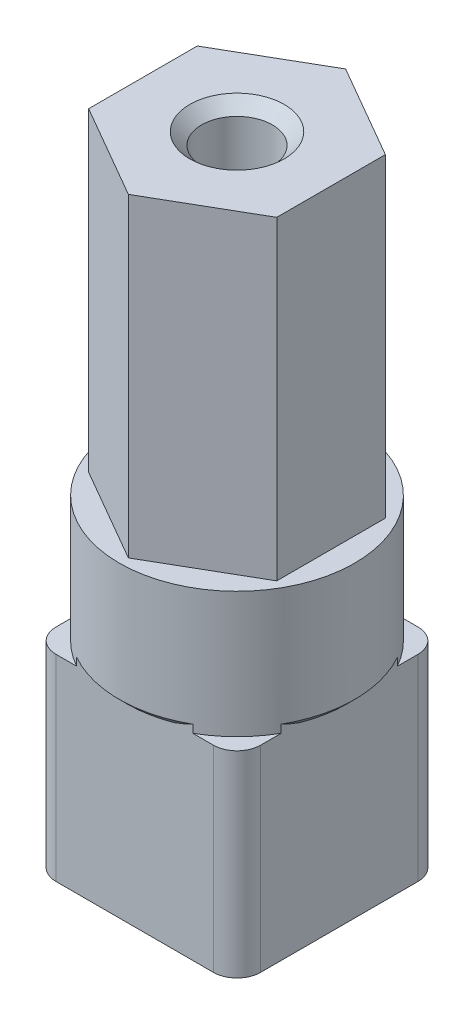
ISO-10303-21;
HEADER;
FILE_DESCRIPTION(('STEP AP214'),'2;1');
FILE_NAME('part.step','',(''),(''),'','','');
FILE_SCHEMA(('AUTOMOTIVE_DESIGN { 1 0 10303 214 1 1 1 1 }'));
ENDSEC;
DATA;
#1=APPLICATION_CONTEXT('core data for automotive mechanical design processes');
#2=APPLICATION_PROTOCOL_DEFINITION('international standard','automotive_design',2000,#1);
#3=PRODUCT_CONTEXT('',#1,'mechanical');
#4=PRODUCT('Part','Part','',(#3));
#5=PRODUCT_RELATED_PRODUCT_CATEGORY('part','',(#4));
#6=PRODUCT_DEFINITION_FORMATION('','',#4);
#7=PRODUCT_DEFINITION_CONTEXT('part definition',#1,'design');
#8=PRODUCT_DEFINITION('design','',#6,#7);
#9=PRODUCT_DEFINITION_SHAPE('','',#8);
#10=(LENGTH_UNIT() NAMED_UNIT(*) SI_UNIT(.MILLI.,.METRE.));
#11=(NAMED_UNIT(*) PLANE_ANGLE_UNIT() SI_UNIT($,.RADIAN.));
#12=(NAMED_UNIT(*) SI_UNIT($,.STERADIAN.) SOLID_ANGLE_UNIT());
#13=UNCERTAINTY_MEASURE_WITH_UNIT(LENGTH_MEASURE(1.E-05),#10,'distance_accuracy_value','');
#14=(GEOMETRIC_REPRESENTATION_CONTEXT(3) GLOBAL_UNCERTAINTY_ASSIGNED_CONTEXT((#13)) GLOBAL_UNIT_ASSIGNED_CONTEXT((#10,
#11,#12)) REPRESENTATION_CONTEXT('',''));
#15=CARTESIAN_POINT('',(0.,0.,0.));
#16=DIRECTION('',(0.,0.,1.));
#17=DIRECTION('',(1.,0.,0.));
#18=AXIS2_PLACEMENT_3D('',#15,#16,#17);
#19=CARTESIAN_POINT('',(0.,41.,0.));
#20=DIRECTION('',(0.,1.,0.));
#21=DIRECTION('',(0.,0.,1.));
#22=AXIS2_PLACEMENT_3D('',#19,#20,#21);
#23=PLANE('',#22);
#24=CARTESIAN_POINT('',(0.,41.,0.));
#25=DIRECTION('',(0.,1.,0.));
#26=DIRECTION('',(0.,0.,1.));
#27=AXIS2_PLACEMENT_3D('',#24,#25,#26);
#28=CIRCLE('',#27,14.95);
#29=CARTESIAN_POINT('',(0.,41.,14.95));
#30=VERTEX_POINT('',#29);
#31=EDGE_CURVE('E244',#30,#30,#28,.T.);
#32=ORIENTED_EDGE('',*,*,#31,.T.);
#33=EDGE_LOOP('',(#32));
#34=FACE_BOUND('',#33,.T.);
#35=DIRECTION('',(-0.866025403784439,0.,0.5));
#36=VECTOR('',#35,1.);
#37=CARTESIAN_POINT('',(0.,41.,-13.7986714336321));
#38=LINE('',#37,#36);
#39=CARTESIAN_POINT('',(0.,41.,-13.7986714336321));
#40=VERTEX_POINT('',#39);
#41=CARTESIAN_POINT('',(-11.95,41.,-6.89933571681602));
#42=VERTEX_POINT('',#41);
#43=EDGE_CURVE('E943',#40,#42,#38,.T.);
#44=ORIENTED_EDGE('',*,*,#43,.F.);
#45=DIRECTION('',(-0.866025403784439,0.,-0.5));
#46=VECTOR('',#45,1.);
#47=CARTESIAN_POINT('',(11.95,41.,-6.89933571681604));
#48=LINE('',#47,#46);
#49=CARTESIAN_POINT('',(11.95,41.,-6.89933571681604));
#50=VERTEX_POINT('',#49);
#51=EDGE_CURVE('E236',#50,#40,#48,.T.);
#52=ORIENTED_EDGE('',*,*,#51,.F.);
#53=DIRECTION('',(0.,0.,-1.));
#54=VECTOR('',#53,1.);
#55=CARTESIAN_POINT('',(11.95,41.,6.89933571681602));
#56=LINE('',#55,#54);
#57=CARTESIAN_POINT('',(11.95,41.,6.89933571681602));
#58=VERTEX_POINT('',#57);
#59=EDGE_CURVE('E232',#58,#50,#56,.T.);
#60=ORIENTED_EDGE('',*,*,#59,.F.);
#61=DIRECTION('',(0.866025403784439,0.,-0.5));
#62=VECTOR('',#61,1.);
#63=CARTESIAN_POINT('',(0.,41.,13.798671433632));
#64=LINE('',#63,#62);
#65=CARTESIAN_POINT('',(0.,41.,13.798671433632));
#66=VERTEX_POINT('',#65);
#67=EDGE_CURVE('E953',#66,#58,#64,.T.);
#68=ORIENTED_EDGE('',*,*,#67,.F.);
#69=DIRECTION('',(0.866025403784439,0.,0.5));
#70=VECTOR('',#69,1.);
#71=CARTESIAN_POINT('',(-11.95,41.,6.89933571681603));
#72=LINE('',#71,#70);
#73=CARTESIAN_POINT('',(-11.95,41.,6.89933571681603));
#74=VERTEX_POINT('',#73);
#75=EDGE_CURVE('E942',#74,#66,#72,.T.);
#76=ORIENTED_EDGE('',*,*,#75,.F.);
#77=DIRECTION('',(0.,0.,1.));
#78=VECTOR('',#77,1.);
#79=CARTESIAN_POINT('',(-11.95,41.,-6.89933571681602));
#80=LINE('',#79,#78);
#81=EDGE_CURVE('E937',#42,#74,#80,.T.);
#82=ORIENTED_EDGE('',*,*,#81,.F.);
#83=EDGE_LOOP('',(#44,#52,#60,#68,#76,#82));
#84=FACE_BOUND('',#83,.T.);
#85=ADVANCED_FACE('F36',(#34,#84),#23,.T.);
#86=CARTESIAN_POINT('',(9.99999999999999,25.,9.99999999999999));
#87=DIRECTION('',(0.,1.,0.));
#88=DIRECTION('',(0.,0.,1.));
#89=AXIS2_PLACEMENT_3D('',#86,#87,#88);
#90=PLANE('',#89);
#91=CARTESIAN_POINT('',(0.,25.,0.));
#92=DIRECTION('',(0.,1.,0.));
#93=DIRECTION('',(0.,0.,1.));
#94=AXIS2_PLACEMENT_3D('',#91,#92,#93);
#95=CIRCLE('',#94,14.95);
#96=CARTESIAN_POINT('',(7.38258084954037,25.,13.));
#97=VERTEX_POINT('',#96);
#98=CARTESIAN_POINT('',(13.,25.,7.38258084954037));
#99=VERTEX_POINT('',#98);
#100=EDGE_CURVE('E239',#97,#99,#95,.T.);
#101=ORIENTED_EDGE('',*,*,#100,.F.);
#102=DIRECTION('',(1.,0.,0.));
#103=VECTOR('',#102,1.);
#104=CARTESIAN_POINT('',(9.99999999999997,25.,13.));
#105=LINE('',#104,#103);
#106=CARTESIAN_POINT('',(9.99999999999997,25.,13.));
#107=VERTEX_POINT('',#106);
#108=EDGE_CURVE('E289',#97,#107,#105,.T.);
#109=ORIENTED_EDGE('',*,*,#108,.T.);
#110=CARTESIAN_POINT('',(9.99999999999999,25.,9.99999999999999));
#111=DIRECTION('',(0.,1.,0.));
#112=DIRECTION('',(0.,0.,1.));
#113=AXIS2_PLACEMENT_3D('',#110,#111,#112);
#114=CIRCLE('',#113,3.);
#115=CARTESIAN_POINT('',(13.,25.,9.99999999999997));
#116=VERTEX_POINT('',#115);
#117=EDGE_CURVE('E257',#107,#116,#114,.T.);
#118=ORIENTED_EDGE('',*,*,#117,.T.);
#119=DIRECTION('',(0.,0.,-1.));
#120=VECTOR('',#119,1.);
#121=CARTESIAN_POINT('',(13.,25.,9.99999999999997));
#122=LINE('',#121,#120);
#123=EDGE_CURVE('E263',#116,#99,#122,.T.);
#124=ORIENTED_EDGE('',*,*,#123,.T.);
#125=EDGE_LOOP('',(#101,#109,#118,#124));
#126=FACE_BOUND('',#125,.T.);
#127=ADVANCED_FACE('F519',(#126),#90,.T.);
#128=CARTESIAN_POINT('',(13.,25.,-7.38258084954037));
#129=VERTEX_POINT('',#128);
#130=CARTESIAN_POINT('',(7.38258084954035,25.,-13.));
#131=VERTEX_POINT('',#130);
#132=EDGE_CURVE('E246',#129,#131,#95,.T.);
#133=ORIENTED_EDGE('',*,*,#132,.F.);
#134=CARTESIAN_POINT('',(13.,25.,-9.99999999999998));
#135=VERTEX_POINT('',#134);
#136=EDGE_CURVE('E261',#129,#135,#122,.T.);
#137=ORIENTED_EDGE('',*,*,#136,.T.);
#138=CARTESIAN_POINT('',(9.99999999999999,25.,-10.));
#139=DIRECTION('',(0.,1.,0.));
#140=DIRECTION('',(0.,0.,1.));
#141=AXIS2_PLACEMENT_3D('',#138,#139,#140);
#142=CIRCLE('',#141,3.);
#143=CARTESIAN_POINT('',(9.99999999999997,25.,-13.));
#144=VERTEX_POINT('',#143);
#145=EDGE_CURVE('E267',#135,#144,#142,.T.);
#146=ORIENTED_EDGE('',*,*,#145,.T.);
#147=DIRECTION('',(-1.,0.,0.));
#148=VECTOR('',#147,1.);
#149=CARTESIAN_POINT('',(9.99999999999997,25.,-13.));
#150=LINE('',#149,#148);
#151=EDGE_CURVE('E272',#144,#131,#150,.T.);
#152=ORIENTED_EDGE('',*,*,#151,.T.);
#153=EDGE_LOOP('',(#133,#137,#146,#152));
#154=FACE_BOUND('',#153,.T.);
#155=ADVANCED_FACE('F525',(#154),#90,.T.);
#156=CARTESIAN_POINT('',(-7.38258084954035,25.,-13.));
#157=VERTEX_POINT('',#156);
#158=CARTESIAN_POINT('',(-13.,25.,-7.38258084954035));
#159=VERTEX_POINT('',#158);
#160=EDGE_CURVE('E612',#157,#159,#95,.T.);
#161=ORIENTED_EDGE('',*,*,#160,.F.);
#162=CARTESIAN_POINT('',(-9.99999999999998,25.,-13.));
#163=VERTEX_POINT('',#162);
#164=EDGE_CURVE('E271',#157,#163,#150,.T.);
#165=ORIENTED_EDGE('',*,*,#164,.T.);
#166=CARTESIAN_POINT('',(-10.,25.,-10.));
#167=DIRECTION('',(0.,1.,0.));
#168=DIRECTION('',(0.,0.,1.));
#169=AXIS2_PLACEMENT_3D('',#166,#167,#168);
#170=CIRCLE('',#169,3.);
#171=CARTESIAN_POINT('',(-13.,25.,-9.99999999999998));
#172=VERTEX_POINT('',#171);
#173=EDGE_CURVE('E276',#163,#172,#170,.T.);
#174=ORIENTED_EDGE('',*,*,#173,.T.);
#175=DIRECTION('',(0.,0.,1.));
#176=VECTOR('',#175,1.);
#177=CARTESIAN_POINT('',(-13.,25.,9.99999999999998));
#178=LINE('',#177,#176);
#179=EDGE_CURVE('E281',#172,#159,#178,.T.);
#180=ORIENTED_EDGE('',*,*,#179,.T.);
#181=EDGE_LOOP('',(#161,#165,#174,#180));
#182=FACE_BOUND('',#181,.T.);
#183=ADVANCED_FACE('F545',(#182),#90,.T.);
#184=CARTESIAN_POINT('',(9.99999999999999,25.,9.99999999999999));
#185=DIRECTION('',(0.,-1.,0.));
#186=DIRECTION('',(0.,0.,-1.));
#187=AXIS2_PLACEMENT_3D('',#184,#185,#186);
#188=CYLINDRICAL_SURFACE('',#187,3.);
#189=CARTESIAN_POINT('',(9.99999999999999,0.,9.99999999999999));
#190=DIRECTION('',(0.,1.,0.));
#191=DIRECTION('',(0.,0.,1.));
#192=AXIS2_PLACEMENT_3D('',#189,#190,#191);
#193=CIRCLE('',#192,3.);
#194=CARTESIAN_POINT('',(9.99999999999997,0.,13.));
#195=VERTEX_POINT('',#194);
#196=CARTESIAN_POINT('',(13.,0.,9.99999999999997));
#197=VERTEX_POINT('',#196);
#198=EDGE_CURVE('E255',#195,#197,#193,.T.);
#199=ORIENTED_EDGE('',*,*,#198,.T.);
#200=DIRECTION('',(0.,-1.,0.));
#201=VECTOR('',#200,1.);
#202=CARTESIAN_POINT('',(13.,25.,9.99999999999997));
#203=LINE('',#202,#201);
#204=EDGE_CURVE('E345',#116,#197,#203,.T.);
#205=ORIENTED_EDGE('',*,*,#204,.F.);
#206=ORIENTED_EDGE('',*,*,#117,.F.);
#207=DIRECTION('',(0.,-1.,0.));
#208=VECTOR('',#207,1.);
#209=CARTESIAN_POINT('',(9.99999999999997,25.,13.));
#210=LINE('',#209,#208);
#211=EDGE_CURVE('E294',#107,#195,#210,.T.);
#212=ORIENTED_EDGE('',*,*,#211,.T.);
#213=EDGE_LOOP('',(#199,#205,#206,#212));
#214=FACE_BOUND('',#213,.T.);
#215=ADVANCED_FACE('F558',(#214),#188,.T.);
#216=CARTESIAN_POINT('',(13.,25.,9.99999999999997));
#217=DIRECTION('',(-1.,0.,0.));
#218=DIRECTION('',(0.,0.,1.));
#219=AXIS2_PLACEMENT_3D('',#216,#217,#218);
#220=PLANE('',#219);
#221=DIRECTION('',(0.,0.,-1.));
#222=VECTOR('',#221,1.);
#223=CARTESIAN_POINT('',(13.,0.,9.99999999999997));
#224=LINE('',#223,#222);
#225=CARTESIAN_POINT('',(13.,0.,-9.99999999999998));
#226=VERTEX_POINT('',#225);
#227=EDGE_CURVE('E299',#197,#226,#224,.T.);
#228=ORIENTED_EDGE('',*,*,#227,.T.);
#229=DIRECTION('',(0.,-1.,0.));
#230=VECTOR('',#229,1.);
#231=CARTESIAN_POINT('',(13.,25.,-9.99999999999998));
#232=LINE('',#231,#230);
#233=EDGE_CURVE('E341',#135,#226,#232,.T.);
#234=ORIENTED_EDGE('',*,*,#233,.F.);
#235=ORIENTED_EDGE('',*,*,#136,.F.);
#236=DIRECTION('',(0.,-1.,0.));
#237=VECTOR('',#236,1.);
#238=CARTESIAN_POINT('',(13.,26.,-7.38258084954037));
#239=LINE('',#238,#237);
#240=CARTESIAN_POINT('',(13.,26.,-7.38258084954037));
#241=VERTEX_POINT('',#240);
#242=EDGE_CURVE('E363',#241,#129,#239,.T.);
#243=ORIENTED_EDGE('',*,*,#242,.F.);
#244=CARTESIAN_POINT('',(13.,26.,-7.38258084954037));
#245=CARTESIAN_POINT('',(13.,25.9066217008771,-7.19347367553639));
#246=CARTESIAN_POINT('',(13.,25.8154092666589,-7.00328340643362));
#247=CARTESIAN_POINT('',(13.,25.6378848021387,-6.6208082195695));
#248=CARTESIAN_POINT('',(13.,25.5515690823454,-6.42852501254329));
#249=CARTESIAN_POINT('',(13.,25.3842553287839,-6.04163013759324));
#250=CARTESIAN_POINT('',(13.,25.3032577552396,-5.84701826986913));
#251=CARTESIAN_POINT('',(13.,25.147093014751,-5.45529957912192));
#252=CARTESIAN_POINT('',(13.,25.0719303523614,-5.25819096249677));
#253=CARTESIAN_POINT('',(13.,25.,-5.05989130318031));
#254=B_SPLINE_CURVE_WITH_KNOTS('',3,(#244,#245,#246,#247,#248,#249,#250,#251,#252,#253),
.UNSPECIFIED.,.F.,.F.,(4,2,2,2,4),(0.,0.632719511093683,1.26495578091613,1.89724669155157,
2.5300209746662),.UNSPECIFIED.);
#255=CARTESIAN_POINT('',(13.,25.,-5.05989130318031));
#256=VERTEX_POINT('',#255);
#257=EDGE_CURVE('E485',#241,#256,#254,.T.);
#258=ORIENTED_EDGE('',*,*,#257,.T.);
#259=CARTESIAN_POINT('',(13.,25.,5.05989130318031));
#260=VERTEX_POINT('',#259);
#261=EDGE_CURVE('E268',#260,#256,#122,.T.);
#262=ORIENTED_EDGE('',*,*,#261,.F.);
#263=CARTESIAN_POINT('',(13.,25.,5.05989130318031));
#264=CARTESIAN_POINT('',(13.,25.0719303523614,5.25819096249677));
#265=CARTESIAN_POINT('',(13.,25.147093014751,5.45529957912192));
#266=CARTESIAN_POINT('',(13.,25.3032577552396,5.84701826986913));
#267=CARTESIAN_POINT('',(13.,25.3842553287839,6.04163013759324));
#268=CARTESIAN_POINT('',(13.,25.5515690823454,6.42852501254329));
#269=CARTESIAN_POINT('',(13.,25.6378848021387,6.6208082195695));
#270=CARTESIAN_POINT('',(13.,25.8154092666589,7.00328340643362));
#271=CARTESIAN_POINT('',(13.,25.9066217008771,7.19347367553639));
#272=CARTESIAN_POINT('',(13.,26.,7.38258084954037));
#273=B_SPLINE_CURVE_WITH_KNOTS('',3,(#263,#264,#265,#266,#267,#268,#269,#270,#271,#272),
.UNSPECIFIED.,.F.,.F.,(4,2,2,2,4),(0.,0.632774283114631,1.26506519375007,1.89730146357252,
2.5300209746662),.UNSPECIFIED.);
#274=CARTESIAN_POINT('',(13.,26.,7.38258084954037));
#275=VERTEX_POINT('',#274);
#276=EDGE_CURVE('E491',#260,#275,#273,.T.);
#277=ORIENTED_EDGE('',*,*,#276,.T.);
#278=DIRECTION('',(0.,-1.,0.));
#279=VECTOR('',#278,1.);
#280=CARTESIAN_POINT('',(13.,25.,7.38258084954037));
#281=LINE('',#280,#279);
#282=EDGE_CURVE('E52',#99,#275,#281,.F.);
#283=ORIENTED_EDGE('',*,*,#282,.F.);
#284=ORIENTED_EDGE('',*,*,#123,.F.);
#285=ORIENTED_EDGE('',*,*,#204,.T.);
#286=EDGE_LOOP('',(#228,#234,#235,#243,#258,#262,#277,#283,#284,#285));
#287=FACE_BOUND('',#286,.T.);
#288=ADVANCED_FACE('F496',(#287),#220,.F.);
#289=CARTESIAN_POINT('',(9.99999999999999,25.,-10.));
#290=DIRECTION('',(0.,-1.,0.));
#291=DIRECTION('',(0.,0.,-1.));
#292=AXIS2_PLACEMENT_3D('',#289,#290,#291);
#293=CYLINDRICAL_SURFACE('',#292,3.);
#294=CARTESIAN_POINT('',(9.99999999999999,0.,-10.));
#295=DIRECTION('',(0.,1.,0.));
#296=DIRECTION('',(0.,0.,1.));
#297=AXIS2_PLACEMENT_3D('',#294,#295,#296);
#298=CIRCLE('',#297,3.);
#299=CARTESIAN_POINT('',(9.99999999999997,0.,-13.));
#300=VERTEX_POINT('',#299);
#301=EDGE_CURVE('E302',#226,#300,#298,.T.);
#302=ORIENTED_EDGE('',*,*,#301,.T.);
#303=DIRECTION('',(0.,-1.,0.));
#304=VECTOR('',#303,1.);
#305=CARTESIAN_POINT('',(9.99999999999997,25.,-13.));
#306=LINE('',#305,#304);
#307=EDGE_CURVE('E337',#144,#300,#306,.T.);
#308=ORIENTED_EDGE('',*,*,#307,.F.);
#309=ORIENTED_EDGE('',*,*,#145,.F.);
#310=ORIENTED_EDGE('',*,*,#233,.T.);
#311=EDGE_LOOP('',(#302,#308,#309,#310));
#312=FACE_BOUND('',#311,.T.);
#313=ADVANCED_FACE('F476',(#312),#293,.T.);
#314=CARTESIAN_POINT('',(9.99999999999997,25.,-13.));
#315=DIRECTION('',(0.,0.,1.));
#316=DIRECTION('',(1.,0.,0.));
#317=AXIS2_PLACEMENT_3D('',#314,#315,#316);
#318=PLANE('',#317);
#319=DIRECTION('',(-1.,0.,0.));
#320=VECTOR('',#319,1.);
#321=CARTESIAN_POINT('',(9.99999999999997,0.,-13.));
#322=LINE('',#321,#320);
#323=CARTESIAN_POINT('',(-9.99999999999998,0.,-13.));
#324=VERTEX_POINT('',#323);
#325=EDGE_CURVE('E305',#300,#324,#322,.T.);
#326=ORIENTED_EDGE('',*,*,#325,.T.);
#327=DIRECTION('',(0.,-1.,0.));
#328=VECTOR('',#327,1.);
#329=CARTESIAN_POINT('',(-9.99999999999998,25.,-13.));
#330=LINE('',#329,#328);
#331=EDGE_CURVE('E333',#163,#324,#330,.T.);
#332=ORIENTED_EDGE('',*,*,#331,.F.);
#333=ORIENTED_EDGE('',*,*,#164,.F.);
#334=DIRECTION('',(0.,-1.,0.));
#335=VECTOR('',#334,1.);
#336=CARTESIAN_POINT('',(-7.38258084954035,26.,-13.));
#337=LINE('',#336,#335);
#338=CARTESIAN_POINT('',(-7.38258084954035,26.,-13.));
#339=VERTEX_POINT('',#338);
#340=EDGE_CURVE('E372',#339,#157,#337,.T.);
#341=ORIENTED_EDGE('',*,*,#340,.F.);
#342=CARTESIAN_POINT('',(-7.38258084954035,26.,-13.));
#343=CARTESIAN_POINT('',(-7.19347367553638,25.9066217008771,-13.));
#344=CARTESIAN_POINT('',(-7.00328340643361,25.8154092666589,-13.));
#345=CARTESIAN_POINT('',(-6.62080821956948,25.6378848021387,-13.));
#346=CARTESIAN_POINT('',(-6.42852501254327,25.5515690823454,-13.));
#347=CARTESIAN_POINT('',(-6.04163013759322,25.3842553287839,-13.));
#348=CARTESIAN_POINT('',(-5.84701826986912,25.3032577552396,-13.));
#349=CARTESIAN_POINT('',(-5.4552995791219,25.147093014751,-13.));
#350=CARTESIAN_POINT('',(-5.25819096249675,25.0719303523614,-13.));
#351=CARTESIAN_POINT('',(-5.05989130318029,25.,-13.));
#352=B_SPLINE_CURVE_WITH_KNOTS('',3,(#342,#343,#344,#345,#346,#347,#348,#349,#350,#351),
.UNSPECIFIED.,.F.,.F.,(4,2,2,2,4),(0.,0.632719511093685,1.26495578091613,1.89724669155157,
2.53002097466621),.UNSPECIFIED.);
#353=CARTESIAN_POINT('',(-5.05989130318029,25.,-13.));
#354=VERTEX_POINT('',#353);
#355=EDGE_CURVE('E456',#339,#354,#352,.T.);
#356=ORIENTED_EDGE('',*,*,#355,.T.);
#357=CARTESIAN_POINT('',(5.05989130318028,25.,-13.));
#358=VERTEX_POINT('',#357);
#359=EDGE_CURVE('E277',#358,#354,#150,.T.);
#360=ORIENTED_EDGE('',*,*,#359,.F.);
#361=CARTESIAN_POINT('',(5.05989130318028,25.,-13.));
#362=CARTESIAN_POINT('',(5.25819096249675,25.0719303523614,-13.));
#363=CARTESIAN_POINT('',(5.4552995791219,25.147093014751,-13.));
#364=CARTESIAN_POINT('',(5.84701826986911,25.3032577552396,-13.));
#365=CARTESIAN_POINT('',(6.04163013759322,25.3842553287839,-13.));
#366=CARTESIAN_POINT('',(6.42852501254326,25.5515690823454,-13.));
#367=CARTESIAN_POINT('',(6.62080821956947,25.6378848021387,-13.));
#368=CARTESIAN_POINT('',(7.0032834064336,25.8154092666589,-13.));
#369=CARTESIAN_POINT('',(7.19347367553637,25.9066217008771,-13.));
#370=CARTESIAN_POINT('',(7.38258084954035,26.,-13.));
#371=B_SPLINE_CURVE_WITH_KNOTS('',3,(#361,#362,#363,#364,#365,#366,#367,#368,#369,#370),
.UNSPECIFIED.,.F.,.F.,(4,2,2,2,4),(0.,0.632774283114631,1.26506519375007,1.89730146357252,
2.53002097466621),.UNSPECIFIED.);
#372=CARTESIAN_POINT('',(7.38258084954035,26.,-13.));
#373=VERTEX_POINT('',#372);
#374=EDGE_CURVE('E479',#358,#373,#371,.T.);
#375=ORIENTED_EDGE('',*,*,#374,.T.);
#376=DIRECTION('',(0.,-1.,0.));
#377=VECTOR('',#376,1.);
#378=CARTESIAN_POINT('',(7.38258084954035,25.,-13.));
#379=LINE('',#378,#377);
#380=EDGE_CURVE('E60',#131,#373,#379,.F.);
#381=ORIENTED_EDGE('',*,*,#380,.F.);
#382=ORIENTED_EDGE('',*,*,#151,.F.);
#383=ORIENTED_EDGE('',*,*,#307,.T.);
#384=EDGE_LOOP('',(#326,#332,#333,#341,#356,#360,#375,#381,#382,#383));
#385=FACE_BOUND('',#384,.T.);
#386=ADVANCED_FACE('F471',(#385),#318,.F.);
#387=CARTESIAN_POINT('',(-10.,25.,-10.));
#388=DIRECTION('',(0.,-1.,0.));
#389=DIRECTION('',(0.,0.,-1.));
#390=AXIS2_PLACEMENT_3D('',#387,#388,#389);
#391=CYLINDRICAL_SURFACE('',#390,3.);
#392=CARTESIAN_POINT('',(-10.,0.,-10.));
#393=DIRECTION('',(0.,1.,0.));
#394=DIRECTION('',(0.,0.,1.));
#395=AXIS2_PLACEMENT_3D('',#392,#393,#394);
#396=CIRCLE('',#395,3.);
#397=CARTESIAN_POINT('',(-13.,0.,-9.99999999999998));
#398=VERTEX_POINT('',#397);
#399=EDGE_CURVE('E308',#324,#398,#396,.T.);
#400=ORIENTED_EDGE('',*,*,#399,.T.);
#401=DIRECTION('',(0.,-1.,0.));
#402=VECTOR('',#401,1.);
#403=CARTESIAN_POINT('',(-13.,25.,-9.99999999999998));
#404=LINE('',#403,#402);
#405=EDGE_CURVE('E329',#172,#398,#404,.T.);
#406=ORIENTED_EDGE('',*,*,#405,.F.);
#407=ORIENTED_EDGE('',*,*,#173,.F.);
#408=ORIENTED_EDGE('',*,*,#331,.T.);
#409=EDGE_LOOP('',(#400,#406,#407,#408));
#410=FACE_BOUND('',#409,.T.);
#411=ADVANCED_FACE('F467',(#410),#391,.T.);
#412=CARTESIAN_POINT('',(-13.,25.,9.99999999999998));
#413=DIRECTION('',(1.,0.,0.));
#414=DIRECTION('',(0.,0.,-1.));
#415=AXIS2_PLACEMENT_3D('',#412,#413,#414);
#416=PLANE('',#415);
#417=DIRECTION('',(0.,0.,1.));
#418=VECTOR('',#417,1.);
#419=CARTESIAN_POINT('',(-13.,0.,9.99999999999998));
#420=LINE('',#419,#418);
#421=CARTESIAN_POINT('',(-13.,0.,9.99999999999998));
#422=VERTEX_POINT('',#421);
#423=EDGE_CURVE('E311',#398,#422,#420,.T.);
#424=ORIENTED_EDGE('',*,*,#423,.T.);
#425=DIRECTION('',(0.,-1.,0.));
#426=VECTOR('',#425,1.);
#427=CARTESIAN_POINT('',(-13.,25.,9.99999999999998));
#428=LINE('',#427,#426);
#429=CARTESIAN_POINT('',(-13.,25.,9.99999999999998));
#430=VERTEX_POINT('',#429);
#431=EDGE_CURVE('E325',#430,#422,#428,.T.);
#432=ORIENTED_EDGE('',*,*,#431,.F.);
#433=CARTESIAN_POINT('',(-13.,25.,7.38258084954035));
#434=VERTEX_POINT('',#433);
#435=EDGE_CURVE('E280',#434,#430,#178,.T.);
#436=ORIENTED_EDGE('',*,*,#435,.F.);
#437=DIRECTION('',(0.,-1.,0.));
#438=VECTOR('',#437,1.);
#439=CARTESIAN_POINT('',(-13.,26.,7.38258084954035));
#440=LINE('',#439,#438);
#441=CARTESIAN_POINT('',(-13.,26.,7.38258084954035));
#442=VERTEX_POINT('',#441);
#443=EDGE_CURVE('E383',#442,#434,#440,.T.);
#444=ORIENTED_EDGE('',*,*,#443,.F.);
#445=CARTESIAN_POINT('',(-13.,26.,7.38258084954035));
#446=CARTESIAN_POINT('',(-13.,25.9066217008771,7.19347367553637));
#447=CARTESIAN_POINT('',(-13.,25.8154092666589,7.0032834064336));
#448=CARTESIAN_POINT('',(-13.,25.6378848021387,6.62080821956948));
#449=CARTESIAN_POINT('',(-13.,25.5515690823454,6.42852501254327));
#450=CARTESIAN_POINT('',(-13.,25.3842553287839,6.04163013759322));
#451=CARTESIAN_POINT('',(-13.,25.3032577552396,5.84701826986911));
#452=CARTESIAN_POINT('',(-13.,25.147093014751,5.45529957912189));
#453=CARTESIAN_POINT('',(-13.,25.0719303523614,5.25819096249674));
#454=CARTESIAN_POINT('',(-13.,25.,5.05989130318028));
#455=B_SPLINE_CURVE_WITH_KNOTS('',3,(#445,#446,#447,#448,#449,#450,#451,#452,#453,#454),
.UNSPECIFIED.,.F.,.F.,(4,2,2,2,4),(0.,0.632719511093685,1.26495578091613,1.89724669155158,
2.53002097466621),.UNSPECIFIED.);
#456=CARTESIAN_POINT('',(-13.,25.,5.05989130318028));
#457=VERTEX_POINT('',#456);
#458=EDGE_CURVE('E444',#442,#457,#455,.T.);
#459=ORIENTED_EDGE('',*,*,#458,.T.);
#460=CARTESIAN_POINT('',(-13.,25.,-5.05989130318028));
#461=VERTEX_POINT('',#460);
#462=EDGE_CURVE('E286',#461,#457,#178,.T.);
#463=ORIENTED_EDGE('',*,*,#462,.F.);
#464=CARTESIAN_POINT('',(-13.,25.,-5.05989130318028));
#465=CARTESIAN_POINT('',(-13.,25.0719303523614,-5.25819096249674));
#466=CARTESIAN_POINT('',(-13.,25.147093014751,-5.45529957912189));
#467=CARTESIAN_POINT('',(-13.,25.3032577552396,-5.84701826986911));
#468=CARTESIAN_POINT('',(-13.,25.3842553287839,-6.04163013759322));
#469=CARTESIAN_POINT('',(-13.,25.5515690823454,-6.42852501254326));
#470=CARTESIAN_POINT('',(-13.,25.6378848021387,-6.62080821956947));
#471=CARTESIAN_POINT('',(-13.,25.8154092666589,-7.0032834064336));
#472=CARTESIAN_POINT('',(-13.,25.9066217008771,-7.19347367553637));
#473=CARTESIAN_POINT('',(-13.,26.,-7.38258084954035));
#474=B_SPLINE_CURVE_WITH_KNOTS('',3,(#464,#465,#466,#467,#468,#469,#470,#471,#472,#473),
.UNSPECIFIED.,.F.,.F.,(4,2,2,2,4),(0.,0.632774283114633,1.26506519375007,1.89730146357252,
2.53002097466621),.UNSPECIFIED.);
#475=CARTESIAN_POINT('',(-13.,26.,-7.38258084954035));
#476=VERTEX_POINT('',#475);
#477=EDGE_CURVE('E450',#461,#476,#474,.T.);
#478=ORIENTED_EDGE('',*,*,#477,.T.);
#479=DIRECTION('',(0.,-1.,0.));
#480=VECTOR('',#479,1.);
#481=CARTESIAN_POINT('',(-13.,25.,-7.38258084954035));
#482=LINE('',#481,#480);
#483=EDGE_CURVE('E375',#159,#476,#482,.F.);
#484=ORIENTED_EDGE('',*,*,#483,.F.);
#485=ORIENTED_EDGE('',*,*,#179,.F.);
#486=ORIENTED_EDGE('',*,*,#405,.T.);
#487=EDGE_LOOP('',(#424,#432,#436,#444,#459,#463,#478,#484,#485,#486));
#488=FACE_BOUND('',#487,.T.);
#489=ADVANCED_FACE('F462',(#488),#416,.F.);
#490=CARTESIAN_POINT('',(-10.,25.,10.));
#491=DIRECTION('',(0.,-1.,0.));
#492=DIRECTION('',(0.,0.,-1.));
#493=AXIS2_PLACEMENT_3D('',#490,#491,#492);
#494=CYLINDRICAL_SURFACE('',#493,3.);
#495=CARTESIAN_POINT('',(-10.,0.,10.));
#496=DIRECTION('',(0.,1.,0.));
#497=DIRECTION('',(0.,0.,-1.));
#498=AXIS2_PLACEMENT_3D('',#495,#496,#497);
#499=CIRCLE('',#498,3.);
#500=CARTESIAN_POINT('',(-9.99999999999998,0.,13.));
#501=VERTEX_POINT('',#500);
#502=EDGE_CURVE('E314',#422,#501,#499,.T.);
#503=ORIENTED_EDGE('',*,*,#502,.T.);
#504=DIRECTION('',(0.,-1.,0.));
#505=VECTOR('',#504,1.);
#506=CARTESIAN_POINT('',(-9.99999999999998,25.,13.));
#507=LINE('',#506,#505);
#508=CARTESIAN_POINT('',(-9.99999999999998,25.,13.));
#509=VERTEX_POINT('',#508);
#510=EDGE_CURVE('E321',#509,#501,#507,.T.);
#511=ORIENTED_EDGE('',*,*,#510,.F.);
#512=CARTESIAN_POINT('',(-10.,25.,10.));
#513=DIRECTION('',(0.,1.,0.));
#514=DIRECTION('',(0.,0.,-1.));
#515=AXIS2_PLACEMENT_3D('',#512,#513,#514);
#516=CIRCLE('',#515,3.);
#517=EDGE_CURVE('E285',#430,#509,#516,.T.);
#518=ORIENTED_EDGE('',*,*,#517,.F.);
#519=ORIENTED_EDGE('',*,*,#431,.T.);
#520=EDGE_LOOP('',(#503,#511,#518,#519));
#521=FACE_BOUND('',#520,.T.);
#522=ADVANCED_FACE('F466',(#521),#494,.T.);
#523=CARTESIAN_POINT('',(9.99999999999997,25.,13.));
#524=DIRECTION('',(0.,0.,-1.));
#525=DIRECTION('',(-1.,0.,0.));
#526=AXIS2_PLACEMENT_3D('',#523,#524,#525);
#527=PLANE('',#526);
#528=DIRECTION('',(1.,0.,0.));
#529=VECTOR('',#528,1.);
#530=CARTESIAN_POINT('',(9.99999999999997,0.,13.));
#531=LINE('',#530,#529);
#532=EDGE_CURVE('E262',#501,#195,#531,.T.);
#533=ORIENTED_EDGE('',*,*,#532,.T.);
#534=ORIENTED_EDGE('',*,*,#211,.F.);
#535=ORIENTED_EDGE('',*,*,#108,.F.);
#536=DIRECTION('',(0.,-1.,0.));
#537=VECTOR('',#536,1.);
#538=CARTESIAN_POINT('',(7.38258084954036,26.,13.));
#539=LINE('',#538,#537);
#540=CARTESIAN_POINT('',(7.38258084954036,26.,13.));
#541=VERTEX_POINT('',#540);
#542=EDGE_CURVE('E394',#541,#97,#539,.T.);
#543=ORIENTED_EDGE('',*,*,#542,.F.);
#544=CARTESIAN_POINT('',(7.38258084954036,26.,13.));
#545=CARTESIAN_POINT('',(7.19347367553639,25.9066217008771,13.));
#546=CARTESIAN_POINT('',(7.00328340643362,25.8154092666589,13.));
#547=CARTESIAN_POINT('',(6.62080821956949,25.6378848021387,13.));
#548=CARTESIAN_POINT('',(6.42852501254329,25.5515690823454,13.));
#549=CARTESIAN_POINT('',(6.04163013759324,25.3842553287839,13.));
#550=CARTESIAN_POINT('',(5.84701826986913,25.3032577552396,13.));
#551=CARTESIAN_POINT('',(5.45529957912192,25.147093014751,13.));
#552=CARTESIAN_POINT('',(5.25819096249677,25.0719303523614,13.));
#553=CARTESIAN_POINT('',(5.0598913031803,25.,13.));
#554=B_SPLINE_CURVE_WITH_KNOTS('',3,(#544,#545,#546,#547,#548,#549,#550,#551,#552,#553),
.UNSPECIFIED.,.F.,.F.,(4,2,2,2,4),(0.,0.632719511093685,1.26495578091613,1.89724669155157,
2.5300209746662),.UNSPECIFIED.);
#555=CARTESIAN_POINT('',(5.0598913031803,25.,13.));
#556=VERTEX_POINT('',#555);
#557=EDGE_CURVE('E409',#541,#556,#554,.T.);
#558=ORIENTED_EDGE('',*,*,#557,.T.);
#559=CARTESIAN_POINT('',(-5.0598913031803,25.,13.));
#560=VERTEX_POINT('',#559);
#561=EDGE_CURVE('E295',#560,#556,#105,.T.);
#562=ORIENTED_EDGE('',*,*,#561,.F.);
#563=CARTESIAN_POINT('',(-5.0598913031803,25.,13.));
#564=CARTESIAN_POINT('',(-5.25819096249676,25.0719303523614,13.));
#565=CARTESIAN_POINT('',(-5.45529957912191,25.147093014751,13.));
#566=CARTESIAN_POINT('',(-5.84701826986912,25.3032577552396,13.));
#567=CARTESIAN_POINT('',(-6.04163013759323,25.3842553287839,13.));
#568=CARTESIAN_POINT('',(-6.42852501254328,25.5515690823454,13.));
#569=CARTESIAN_POINT('',(-6.62080821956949,25.6378848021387,13.));
#570=CARTESIAN_POINT('',(-7.00328340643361,25.8154092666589,13.));
#571=CARTESIAN_POINT('',(-7.19347367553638,25.9066217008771,13.));
#572=CARTESIAN_POINT('',(-7.38258084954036,26.,13.));
#573=B_SPLINE_CURVE_WITH_KNOTS('',3,(#563,#564,#565,#566,#567,#568,#569,#570,#571,#572),
.UNSPECIFIED.,.F.,.F.,(4,2,2,2,4),(0.,0.632774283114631,1.26506519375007,1.89730146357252,
2.5300209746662),.UNSPECIFIED.);
#574=CARTESIAN_POINT('',(-7.38258084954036,26.,13.));
#575=VERTEX_POINT('',#574);
#576=EDGE_CURVE('E417',#560,#575,#573,.T.);
#577=ORIENTED_EDGE('',*,*,#576,.T.);
#578=DIRECTION('',(0.,-1.,0.));
#579=VECTOR('',#578,1.);
#580=CARTESIAN_POINT('',(-7.38258084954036,25.,13.));
#581=LINE('',#580,#579);
#582=CARTESIAN_POINT('',(-7.38258084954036,25.,13.));
#583=VERTEX_POINT('',#582);
#584=EDGE_CURVE('E386',#583,#575,#581,.F.);
#585=ORIENTED_EDGE('',*,*,#584,.F.);
#586=EDGE_CURVE('E290',#509,#583,#105,.T.);
#587=ORIENTED_EDGE('',*,*,#586,.F.);
#588=ORIENTED_EDGE('',*,*,#510,.T.);
#589=EDGE_LOOP('',(#533,#534,#535,#543,#558,#562,#577,#585,#587,#588));
#590=FACE_BOUND('',#589,.T.);
#591=ADVANCED_FACE('F422',(#590),#527,.F.);
#592=EDGE_CURVE('E247',#434,#583,#95,.T.);
#593=ORIENTED_EDGE('',*,*,#592,.F.);
#594=ORIENTED_EDGE('',*,*,#435,.T.);
#595=ORIENTED_EDGE('',*,*,#517,.T.);
#596=ORIENTED_EDGE('',*,*,#586,.T.);
#597=EDGE_LOOP('',(#593,#594,#595,#596));
#598=FACE_BOUND('',#597,.T.);
#599=ADVANCED_FACE('F528',(#598),#90,.T.);
#600=CARTESIAN_POINT('',(9.99999999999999,0.,9.99999999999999));
#601=DIRECTION('',(0.,1.,0.));
#602=DIRECTION('',(0.,0.,1.));
#603=AXIS2_PLACEMENT_3D('',#600,#601,#602);
#604=PLANE('',#603);
#605=CARTESIAN_POINT('',(0.,0.,0.));
#606=DIRECTION('',(0.,1.,0.));
#607=DIRECTION('',(0.,0.,1.));
#608=AXIS2_PLACEMENT_3D('',#605,#606,#607);
#609=CIRCLE('',#608,9.95996839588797);
#610=CARTESIAN_POINT('',(0.,0.,-9.95996839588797));
#611=VERTEX_POINT('',#610);
#612=EDGE_CURVE('E349',#611,#611,#609,.T.);
#613=ORIENTED_EDGE('',*,*,#612,.T.);
#614=EDGE_LOOP('',(#613));
#615=FACE_BOUND('',#614,.T.);
#616=ORIENTED_EDGE('',*,*,#198,.F.);
#617=ORIENTED_EDGE('',*,*,#532,.F.);
#618=ORIENTED_EDGE('',*,*,#502,.F.);
#619=ORIENTED_EDGE('',*,*,#423,.F.);
#620=ORIENTED_EDGE('',*,*,#399,.F.);
#621=ORIENTED_EDGE('',*,*,#325,.F.);
#622=ORIENTED_EDGE('',*,*,#301,.F.);
#623=ORIENTED_EDGE('',*,*,#227,.F.);
#624=EDGE_LOOP('',(#616,#617,#618,#619,#620,#621,#622,#623));
#625=FACE_BOUND('',#624,.T.);
#626=ADVANCED_FACE('F537',(#615,#625),#604,.F.);
#627=CARTESIAN_POINT('',(0.,25.,0.));
#628=DIRECTION('',(0.,1.,0.));
#629=DIRECTION('',(0.,0.,1.));
#630=AXIS2_PLACEMENT_3D('',#627,#628,#629);
#631=PLANE('',#630);
#632=ORIENTED_EDGE('',*,*,#261,.T.);
#633=CARTESIAN_POINT('',(0.,25.,0.));
#634=DIRECTION('',(0.,1.,0.));
#635=DIRECTION('',(0.,0.,1.));
#636=AXIS2_PLACEMENT_3D('',#633,#634,#635);
#637=CIRCLE('',#636,13.95);
#638=EDGE_CURVE('E406',#256,#260,#637,.F.);
#639=ORIENTED_EDGE('',*,*,#638,.T.);
#640=EDGE_LOOP('',(#632,#639));
#641=FACE_BOUND('',#640,.T.);
#642=ADVANCED_FACE('F533',(#641),#631,.F.);
#643=ORIENTED_EDGE('',*,*,#359,.T.);
#644=CARTESIAN_POINT('',(0.,25.,0.));
#645=DIRECTION('',(0.,1.,0.));
#646=DIRECTION('',(0.,0.,1.));
#647=AXIS2_PLACEMENT_3D('',#644,#645,#646);
#648=CIRCLE('',#647,13.95);
#649=EDGE_CURVE('E403',#354,#358,#648,.F.);
#650=ORIENTED_EDGE('',*,*,#649,.T.);
#651=EDGE_LOOP('',(#643,#650));
#652=FACE_BOUND('',#651,.T.);
#653=ADVANCED_FACE('F536',(#652),#631,.F.);
#654=ORIENTED_EDGE('',*,*,#462,.T.);
#655=CARTESIAN_POINT('',(0.,25.,0.));
#656=DIRECTION('',(0.,1.,0.));
#657=DIRECTION('',(0.,0.,1.));
#658=AXIS2_PLACEMENT_3D('',#655,#656,#657);
#659=CIRCLE('',#658,13.95);
#660=EDGE_CURVE('E400',#457,#461,#659,.F.);
#661=ORIENTED_EDGE('',*,*,#660,.T.);
#662=EDGE_LOOP('',(#654,#661));
#663=FACE_BOUND('',#662,.T.);
#664=ADVANCED_FACE('F607',(#663),#631,.F.);
#665=ORIENTED_EDGE('',*,*,#561,.T.);
#666=CARTESIAN_POINT('',(0.,25.,0.));
#667=DIRECTION('',(0.,1.,0.));
#668=DIRECTION('',(0.,0.,1.));
#669=AXIS2_PLACEMENT_3D('',#666,#667,#668);
#670=CIRCLE('',#669,13.95);
#671=EDGE_CURVE('E397',#556,#560,#670,.F.);
#672=ORIENTED_EDGE('',*,*,#671,.T.);
#673=EDGE_LOOP('',(#665,#672));
#674=FACE_BOUND('',#673,.T.);
#675=ADVANCED_FACE('F539',(#674),#631,.F.);
#676=CARTESIAN_POINT('',(0.,41.,0.));
#677=DIRECTION('',(0.,-1.,0.));
#678=DIRECTION('',(0.,0.,-1.));
#679=AXIS2_PLACEMENT_3D('',#676,#677,#678);
#680=CYLINDRICAL_SURFACE('',#679,14.95);
#681=ORIENTED_EDGE('',*,*,#31,.F.);
#682=EDGE_LOOP('',(#681));
#683=FACE_BOUND('',#682,.T.);
#684=CARTESIAN_POINT('',(0.,26.,0.));
#685=DIRECTION('',(0.,1.,0.));
#686=DIRECTION('',(0.,0.,1.));
#687=AXIS2_PLACEMENT_3D('',#684,#685,#686);
#688=CIRCLE('',#687,14.95);
#689=EDGE_CURVE('E390',#575,#541,#688,.T.);
#690=ORIENTED_EDGE('',*,*,#689,.T.);
#691=ORIENTED_EDGE('',*,*,#542,.T.);
#692=ORIENTED_EDGE('',*,*,#100,.T.);
#693=ORIENTED_EDGE('',*,*,#282,.T.);
#694=CARTESIAN_POINT('',(0.,26.,0.));
#695=DIRECTION('',(0.,1.,0.));
#696=DIRECTION('',(0.,0.,1.));
#697=AXIS2_PLACEMENT_3D('',#694,#695,#696);
#698=CIRCLE('',#697,14.95);
#699=EDGE_CURVE('E359',#275,#241,#698,.T.);
#700=ORIENTED_EDGE('',*,*,#699,.T.);
#701=ORIENTED_EDGE('',*,*,#242,.T.);
#702=ORIENTED_EDGE('',*,*,#132,.T.);
#703=ORIENTED_EDGE('',*,*,#380,.T.);
#704=CARTESIAN_POINT('',(0.,26.,0.));
#705=DIRECTION('',(0.,1.,0.));
#706=DIRECTION('',(0.,0.,1.));
#707=AXIS2_PLACEMENT_3D('',#704,#705,#706);
#708=CIRCLE('',#707,14.95);
#709=EDGE_CURVE('E368',#373,#339,#708,.T.);
#710=ORIENTED_EDGE('',*,*,#709,.T.);
#711=ORIENTED_EDGE('',*,*,#340,.T.);
#712=ORIENTED_EDGE('',*,*,#160,.T.);
#713=ORIENTED_EDGE('',*,*,#483,.T.);
#714=CARTESIAN_POINT('',(0.,26.,0.));
#715=DIRECTION('',(0.,1.,0.));
#716=DIRECTION('',(0.,0.,1.));
#717=AXIS2_PLACEMENT_3D('',#714,#715,#716);
#718=CIRCLE('',#717,14.95);
#719=EDGE_CURVE('E379',#476,#442,#718,.T.);
#720=ORIENTED_EDGE('',*,*,#719,.T.);
#721=ORIENTED_EDGE('',*,*,#443,.T.);
#722=ORIENTED_EDGE('',*,*,#592,.T.);
#723=ORIENTED_EDGE('',*,*,#584,.T.);
#724=EDGE_LOOP('',(#690,#691,#692,#693,#700,#701,#702,#703,#710,#711,#712,#713,#720,#721,#722,#723));
#725=FACE_BOUND('',#724,.T.);
#726=ADVANCED_FACE('F540',(#683,#725),#680,.T.);
#727=CARTESIAN_POINT('',(11.95,81.,-6.89933571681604));
#728=DIRECTION('',(-0.5,0.,0.866025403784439));
#729=DIRECTION('',(0.866025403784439,0.,0.5));
#730=AXIS2_PLACEMENT_3D('',#727,#728,#729);
#731=PLANE('',#730);
#732=ORIENTED_EDGE('',*,*,#51,.T.);
#733=DIRECTION('',(0.,-1.,0.));
#734=VECTOR('',#733,1.);
#735=CARTESIAN_POINT('',(0.,81.,-13.7986714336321));
#736=LINE('',#735,#734);
#737=CARTESIAN_POINT('',(0.,81.,-13.7986714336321));
#738=VERTEX_POINT('',#737);
#739=EDGE_CURVE('E214',#738,#40,#736,.T.);
#740=ORIENTED_EDGE('',*,*,#739,.F.);
#741=DIRECTION('',(-0.866025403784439,0.,-0.5));
#742=VECTOR('',#741,1.);
#743=CARTESIAN_POINT('',(11.95,81.,-6.89933571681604));
#744=LINE('',#743,#742);
#745=CARTESIAN_POINT('',(11.95,81.,-6.89933571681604));
#746=VERTEX_POINT('',#745);
#747=EDGE_CURVE('E222',#746,#738,#744,.T.);
#748=ORIENTED_EDGE('',*,*,#747,.F.);
#749=DIRECTION('',(0.,-1.,0.));
#750=VECTOR('',#749,1.);
#751=CARTESIAN_POINT('',(11.95,81.,-6.89933571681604));
#752=LINE('',#751,#750);
#753=EDGE_CURVE('E962',#746,#50,#752,.T.);
#754=ORIENTED_EDGE('',*,*,#753,.T.);
#755=EDGE_LOOP('',(#732,#740,#748,#754));
#756=FACE_BOUND('',#755,.T.);
#757=ADVANCED_FACE('F234',(#756),#731,.F.);
#758=CARTESIAN_POINT('',(0.,81.,-13.7986714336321));
#759=DIRECTION('',(0.5,0.,0.866025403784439));
#760=DIRECTION('',(0.866025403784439,0.,-0.5));
#761=AXIS2_PLACEMENT_3D('',#758,#759,#760);
#762=PLANE('',#761);
#763=ORIENTED_EDGE('',*,*,#43,.T.);
#764=DIRECTION('',(0.,-1.,0.));
#765=VECTOR('',#764,1.);
#766=CARTESIAN_POINT('',(-11.95,81.,-6.89933571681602));
#767=LINE('',#766,#765);
#768=CARTESIAN_POINT('',(-11.95,81.,-6.89933571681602));
#769=VERTEX_POINT('',#768);
#770=EDGE_CURVE('E217',#769,#42,#767,.T.);
#771=ORIENTED_EDGE('',*,*,#770,.F.);
#772=DIRECTION('',(-0.866025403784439,0.,0.5));
#773=VECTOR('',#772,1.);
#774=CARTESIAN_POINT('',(0.,81.,-13.7986714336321));
#775=LINE('',#774,#773);
#776=EDGE_CURVE('E210',#738,#769,#775,.T.);
#777=ORIENTED_EDGE('',*,*,#776,.F.);
#778=ORIENTED_EDGE('',*,*,#739,.T.);
#779=EDGE_LOOP('',(#763,#771,#777,#778));
#780=FACE_BOUND('',#779,.T.);
#781=ADVANCED_FACE('F212',(#780),#762,.F.);
#782=CARTESIAN_POINT('',(-11.95,81.,-6.89933571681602));
#783=DIRECTION('',(1.,0.,0.));
#784=DIRECTION('',(0.,0.,-1.));
#785=AXIS2_PLACEMENT_3D('',#782,#783,#784);
#786=PLANE('',#785);
#787=ORIENTED_EDGE('',*,*,#81,.T.);
#788=DIRECTION('',(0.,-1.,0.));
#789=VECTOR('',#788,1.);
#790=CARTESIAN_POINT('',(-11.95,81.,6.89933571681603));
#791=LINE('',#790,#789);
#792=CARTESIAN_POINT('',(-11.95,81.,6.89933571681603));
#793=VERTEX_POINT('',#792);
#794=EDGE_CURVE('E249',#793,#74,#791,.T.);
#795=ORIENTED_EDGE('',*,*,#794,.F.);
#796=DIRECTION('',(0.,0.,1.));
#797=VECTOR('',#796,1.);
#798=CARTESIAN_POINT('',(-11.95,81.,-6.89933571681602));
#799=LINE('',#798,#797);
#800=EDGE_CURVE('E221',#769,#793,#799,.T.);
#801=ORIENTED_EDGE('',*,*,#800,.F.);
#802=ORIENTED_EDGE('',*,*,#770,.T.);
#803=EDGE_LOOP('',(#787,#795,#801,#802));
#804=FACE_BOUND('',#803,.T.);
#805=ADVANCED_FACE('F664',(#804),#786,.F.);
#806=CARTESIAN_POINT('',(-11.95,81.,6.89933571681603));
#807=DIRECTION('',(0.5,0.,-0.866025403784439));
#808=DIRECTION('',(-0.866025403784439,0.,-0.5));
#809=AXIS2_PLACEMENT_3D('',#806,#807,#808);
#810=PLANE('',#809);
#811=ORIENTED_EDGE('',*,*,#75,.T.);
#812=DIRECTION('',(0.,-1.,0.));
#813=VECTOR('',#812,1.);
#814=CARTESIAN_POINT('',(0.,81.,13.798671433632));
#815=LINE('',#814,#813);
#816=CARTESIAN_POINT('',(0.,81.,13.798671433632));
#817=VERTEX_POINT('',#816);
#818=EDGE_CURVE('E949',#817,#66,#815,.T.);
#819=ORIENTED_EDGE('',*,*,#818,.F.);
#820=DIRECTION('',(0.866025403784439,0.,0.5));
#821=VECTOR('',#820,1.);
#822=CARTESIAN_POINT('',(-11.95,81.,6.89933571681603));
#823=LINE('',#822,#821);
#824=EDGE_CURVE('E947',#793,#817,#823,.T.);
#825=ORIENTED_EDGE('',*,*,#824,.F.);
#826=ORIENTED_EDGE('',*,*,#794,.T.);
#827=EDGE_LOOP('',(#811,#819,#825,#826));
#828=FACE_BOUND('',#827,.T.);
#829=ADVANCED_FACE('F660',(#828),#810,.F.);
#830=CARTESIAN_POINT('',(0.,81.,13.798671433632));
#831=DIRECTION('',(-0.5,0.,-0.866025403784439));
#832=DIRECTION('',(-0.866025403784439,0.,0.5));
#833=AXIS2_PLACEMENT_3D('',#830,#831,#832);
#834=PLANE('',#833);
#835=ORIENTED_EDGE('',*,*,#67,.T.);
#836=DIRECTION('',(0.,-1.,0.));
#837=VECTOR('',#836,1.);
#838=CARTESIAN_POINT('',(11.95,81.,6.89933571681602));
#839=LINE('',#838,#837);
#840=CARTESIAN_POINT('',(11.95,81.,6.89933571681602));
#841=VERTEX_POINT('',#840);
#842=EDGE_CURVE('E965',#841,#58,#839,.T.);
#843=ORIENTED_EDGE('',*,*,#842,.F.);
#844=DIRECTION('',(0.866025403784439,0.,-0.5));
#845=VECTOR('',#844,1.);
#846=CARTESIAN_POINT('',(0.,81.,13.798671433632));
#847=LINE('',#846,#845);
#848=EDGE_CURVE('E972',#817,#841,#847,.T.);
#849=ORIENTED_EDGE('',*,*,#848,.F.);
#850=ORIENTED_EDGE('',*,*,#818,.T.);
#851=EDGE_LOOP('',(#835,#843,#849,#850));
#852=FACE_BOUND('',#851,.T.);
#853=ADVANCED_FACE('F652',(#852),#834,.F.);
#854=CARTESIAN_POINT('',(11.95,81.,6.89933571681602));
#855=DIRECTION('',(-1.,0.,0.));
#856=DIRECTION('',(0.,0.,1.));
#857=AXIS2_PLACEMENT_3D('',#854,#855,#856);
#858=PLANE('',#857);
#859=ORIENTED_EDGE('',*,*,#59,.T.);
#860=ORIENTED_EDGE('',*,*,#753,.F.);
#861=DIRECTION('',(0.,0.,-1.));
#862=VECTOR('',#861,1.);
#863=CARTESIAN_POINT('',(11.95,81.,6.89933571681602));
#864=LINE('',#863,#862);
#865=EDGE_CURVE('E227',#841,#746,#864,.T.);
#866=ORIENTED_EDGE('',*,*,#865,.F.);
#867=ORIENTED_EDGE('',*,*,#842,.T.);
#868=EDGE_LOOP('',(#859,#860,#866,#867));
#869=FACE_BOUND('',#868,.T.);
#870=ADVANCED_FACE('F645',(#869),#858,.F.);
#871=CARTESIAN_POINT('',(0.,81.,0.));
#872=DIRECTION('',(0.,1.,0.));
#873=DIRECTION('',(0.,0.,1.));
#874=AXIS2_PLACEMENT_3D('',#871,#872,#873);
#875=PLANE('',#874);
#876=CARTESIAN_POINT('',(0.,81.,0.));
#877=DIRECTION('',(0.,1.,0.));
#878=DIRECTION('',(0.,0.,1.));
#879=AXIS2_PLACEMENT_3D('',#876,#877,#878);
#880=CIRCLE('',#879,5.99999999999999);
#881=CARTESIAN_POINT('',(0.,81.,5.99999999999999));
#882=VERTEX_POINT('',#881);
#883=EDGE_CURVE('E45',#882,#882,#880,.F.);
#884=ORIENTED_EDGE('',*,*,#883,.T.);
#885=EDGE_LOOP('',(#884));
#886=FACE_BOUND('',#885,.T.);
#887=ORIENTED_EDGE('',*,*,#747,.T.);
#888=ORIENTED_EDGE('',*,*,#776,.T.);
#889=ORIENTED_EDGE('',*,*,#800,.T.);
#890=ORIENTED_EDGE('',*,*,#824,.T.);
#891=ORIENTED_EDGE('',*,*,#848,.T.);
#892=ORIENTED_EDGE('',*,*,#865,.T.);
#893=EDGE_LOOP('',(#887,#888,#889,#890,#891,#892));
#894=FACE_BOUND('',#893,.T.);
#895=ADVANCED_FACE('F225',(#886,#894),#875,.T.);
#896=CARTESIAN_POINT('',(0.,0.,0.));
#897=DIRECTION('',(0.,-1.,0.));
#898=DIRECTION('',(0.,0.,-1.));
#899=AXIS2_PLACEMENT_3D('',#896,#897,#898);
#900=CONICAL_SURFACE('',#899,9.95996839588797,0.22689280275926);
#901=CARTESIAN_POINT('',(0.,23.0000000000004,0.));
#902=DIRECTION('',(0.,1.,0.));
#903=DIRECTION('',(0.,0.,1.));
#904=AXIS2_PLACEMENT_3D('',#901,#902,#903);
#905=CIRCLE('',#904,4.65);
#906=CARTESIAN_POINT('',(0.,23.0000000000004,-4.65));
#907=VERTEX_POINT('',#906);
#908=EDGE_CURVE('E353',#907,#907,#905,.F.);
#909=CARTESIAN_POINT('',(0.,23.0000000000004,-4.65));
#910=CARTESIAN_POINT('',(0.,22.760416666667,-4.7053121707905));
#911=CARTESIAN_POINT('',(0.,22.5208333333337,-4.760624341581));
#912=CARTESIAN_POINT('',(0.,22.041666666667,-4.871248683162));
#913=CARTESIAN_POINT('',(0.,21.8020833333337,-4.9265608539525));
#914=CARTESIAN_POINT('',(0.,21.322916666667,-5.0371851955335));
#915=CARTESIAN_POINT('',(0.,21.0833333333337,-5.092497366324));
#916=CARTESIAN_POINT('',(0.,20.604166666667,-5.203121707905));
#917=CARTESIAN_POINT('',(0.,20.3645833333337,-5.2584338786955));
#918=CARTESIAN_POINT('',(0.,19.885416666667,-5.3690582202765));
#919=CARTESIAN_POINT('',(0.,19.6458333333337,-5.424370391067));
#920=CARTESIAN_POINT('',(0.,19.166666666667,-5.53499473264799));
#921=CARTESIAN_POINT('',(0.,18.9270833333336,-5.59030690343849));
#922=CARTESIAN_POINT('',(0.,18.447916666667,-5.70093124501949));
#923=CARTESIAN_POINT('',(0.,18.2083333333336,-5.75624341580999));
#924=CARTESIAN_POINT('',(0.,17.729166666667,-5.86686775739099));
#925=CARTESIAN_POINT('',(0.,17.4895833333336,-5.92217992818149));
#926=CARTESIAN_POINT('',(0.,17.010416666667,-6.03280426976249));
#927=CARTESIAN_POINT('',(0.,16.7708333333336,-6.08811644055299));
#928=CARTESIAN_POINT('',(0.,16.2916666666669,-6.19874078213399));
#929=CARTESIAN_POINT('',(0.,16.0520833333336,-6.25405295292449));
#930=CARTESIAN_POINT('',(0.,15.5729166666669,-6.36467729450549));
#931=CARTESIAN_POINT('',(0.,15.3333333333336,-6.41998946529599));
#932=CARTESIAN_POINT('',(0.,14.8541666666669,-6.53061380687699));
#933=CARTESIAN_POINT('',(0.,14.6145833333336,-6.58592597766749));
#934=CARTESIAN_POINT('',(0.,14.1354166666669,-6.69655031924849));
#935=CARTESIAN_POINT('',(0.,13.8958333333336,-6.75186249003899));
#936=CARTESIAN_POINT('',(0.,13.4166666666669,-6.86248683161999));
#937=CARTESIAN_POINT('',(0.,13.1770833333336,-6.91779900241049));
#938=CARTESIAN_POINT('',(0.,12.6979166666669,-7.02842334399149));
#939=CARTESIAN_POINT('',(0.,12.4583333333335,-7.08373551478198));
#940=CARTESIAN_POINT('',(0.,11.9791666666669,-7.19435985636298));
#941=CARTESIAN_POINT('',(0.,11.7395833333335,-7.24967202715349));
#942=CARTESIAN_POINT('',(0.,11.2604166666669,-7.36029636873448));
#943=CARTESIAN_POINT('',(0.,11.0208333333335,-7.41560853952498));
#944=CARTESIAN_POINT('',(0.,10.5416666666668,-7.52623288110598));
#945=CARTESIAN_POINT('',(0.,10.3020833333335,-7.58154505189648));
#946=CARTESIAN_POINT('',(0.,9.82291666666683,-7.69216939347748));
#947=CARTESIAN_POINT('',(0.,9.58333333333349,-7.74748156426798));
#948=CARTESIAN_POINT('',(0.,9.10416666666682,-7.85810590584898));
#949=CARTESIAN_POINT('',(0.,8.86458333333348,-7.91341807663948));
#950=CARTESIAN_POINT('',(0.,8.38541666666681,-8.02404241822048));
#951=CARTESIAN_POINT('',(0.,8.14583333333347,-8.07935458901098));
#952=CARTESIAN_POINT('',(0.,7.66666666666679,-8.18997893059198));
#953=CARTESIAN_POINT('',(0.,7.42708333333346,-8.24529110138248));
#954=CARTESIAN_POINT('',(0.,6.94791666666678,-8.35591544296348));
#955=CARTESIAN_POINT('',(0.,6.70833333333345,-8.41122761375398));
#956=CARTESIAN_POINT('',(0.,6.22916666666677,-8.52185195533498));
#957=CARTESIAN_POINT('',(0.,5.98958333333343,-8.57716412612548));
#958=CARTESIAN_POINT('',(0.,5.51041666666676,-8.68778846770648));
#959=CARTESIAN_POINT('',(0.,5.27083333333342,-8.74310063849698));
#960=CARTESIAN_POINT('',(0.,4.79166666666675,-8.85372498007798));
#961=CARTESIAN_POINT('',(0.,4.55208333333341,-8.90903715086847));
#962=CARTESIAN_POINT('',(0.,4.07291666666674,-9.01966149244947));
#963=CARTESIAN_POINT('',(0.,3.8333333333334,-9.07497366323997));
#964=CARTESIAN_POINT('',(0.,3.35416666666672,-9.18559800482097));
#965=CARTESIAN_POINT('',(0.,3.11458333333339,-9.24091017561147));
#966=CARTESIAN_POINT('',(0.,2.63541666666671,-9.35153451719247));
#967=CARTESIAN_POINT('',(0.,2.39583333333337,-9.40684668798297));
#968=CARTESIAN_POINT('',(0.,1.9166666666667,-9.51747102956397));
#969=CARTESIAN_POINT('',(0.,1.67708333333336,-9.57278320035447));
#970=CARTESIAN_POINT('',(0.,1.19791666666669,-9.68340754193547));
#971=CARTESIAN_POINT('',(0.,0.958333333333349,-9.73871971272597));
#972=CARTESIAN_POINT('',(0.,0.479166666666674,-9.84934405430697));
#973=CARTESIAN_POINT('',(0.,0.239583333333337,-9.90465622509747));
#974=CARTESIAN_POINT('',(0.,0.,-9.95996839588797));
#975=B_SPLINE_CURVE_WITH_KNOTS('',3,(#909,#910,#911,#912,#913,#914,#915,#916,#917,#918,#919,
#920,#921,#922,#923,#924,#925,#926,#927,#928,#929,#930,#931,#932,#933,#934,#935,#936,#937,#938,
#939,#940,#941,#942,#943,#944,#945,#946,#947,#948,#949,#950,#951,#952,#953,#954,#955,#956,#957,
#958,#959,#960,#961,#962,#963,#964,#965,#966,#967,#968,#969,#970,#971,#972,#973,#974),
.UNSPECIFIED.,.F.,.F.,(4,2,2,2,2,2,2,2,2,2,2,2,2,2,2,2,2,2,2,2,2,2,2,2,2,2,2,2,2,2,2,2,4),(0.,
0.737656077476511,1.47531215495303,2.21296823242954,2.95062430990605,3.68828038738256,
4.42593646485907,5.16359254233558,5.9012486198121,6.63890469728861,7.37656077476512,
8.11421685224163,8.85187292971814,9.58952900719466,10.3271850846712,11.0648411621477,
11.8024972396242,12.5401533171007,13.2778093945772,14.0154654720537,14.7531215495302,
15.4907776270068,16.2284337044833,16.9660897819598,17.7037458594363,18.4414019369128,
19.1790580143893,19.9167140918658,20.6543701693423,21.3920262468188,22.1296823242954,
22.8673384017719,23.6049944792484),.UNSPECIFIED.);
#976=EDGE_CURVE('BSEAM432',#907,#611,#975,.T.);
#977=ORIENTED_EDGE('',*,*,#908,.F.);
#978=ORIENTED_EDGE('',*,*,#612,.F.);
#979=ORIENTED_EDGE('',*,*,#976,.T.);
#980=ORIENTED_EDGE('',*,*,#976,.F.);
#981=EDGE_LOOP('',(#977,#979,#978,#980));
#982=FACE_BOUND('',#981,.T.);
#983=ADVANCED_FACE('F432',(#982),#900,.F.);
#984=CARTESIAN_POINT('',(0.,26.,0.));
#985=DIRECTION('',(0.,1.,0.));
#986=DIRECTION('',(0.,0.,1.));
#987=AXIS2_PLACEMENT_3D('',#984,#985,#986);
#988=CONICAL_SURFACE('',#987,14.95,0.785398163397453);
#989=ORIENTED_EDGE('',*,*,#576,.F.);
#990=ORIENTED_EDGE('',*,*,#671,.F.);
#991=ORIENTED_EDGE('',*,*,#557,.F.);
#992=ORIENTED_EDGE('',*,*,#689,.F.);
#993=EDGE_LOOP('',(#989,#990,#991,#992));
#994=FACE_BOUND('',#993,.T.);
#995=ADVANCED_FACE('F426',(#994),#988,.T.);
#996=CARTESIAN_POINT('',(0.,26.,0.));
#997=DIRECTION('',(0.,1.,0.));
#998=DIRECTION('',(0.,0.,1.));
#999=AXIS2_PLACEMENT_3D('',#996,#997,#998);
#1000=CONICAL_SURFACE('',#999,14.95,0.785398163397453);
#1001=ORIENTED_EDGE('',*,*,#477,.F.);
#1002=ORIENTED_EDGE('',*,*,#660,.F.);
#1003=ORIENTED_EDGE('',*,*,#458,.F.);
#1004=ORIENTED_EDGE('',*,*,#719,.F.);
#1005=EDGE_LOOP('',(#1001,#1002,#1003,#1004));
#1006=FACE_BOUND('',#1005,.T.);
#1007=ADVANCED_FACE('F431',(#1006),#1000,.T.);
#1008=CARTESIAN_POINT('',(0.,26.,0.));
#1009=DIRECTION('',(0.,1.,0.));
#1010=DIRECTION('',(0.,0.,1.));
#1011=AXIS2_PLACEMENT_3D('',#1008,#1009,#1010);
#1012=CONICAL_SURFACE('',#1011,14.95,0.785398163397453);
#1013=ORIENTED_EDGE('',*,*,#374,.F.);
#1014=ORIENTED_EDGE('',*,*,#649,.F.);
#1015=ORIENTED_EDGE('',*,*,#355,.F.);
#1016=ORIENTED_EDGE('',*,*,#709,.F.);
#1017=EDGE_LOOP('',(#1013,#1014,#1015,#1016));
#1018=FACE_BOUND('',#1017,.T.);
#1019=ADVANCED_FACE('F439',(#1018),#1012,.T.);
#1020=CARTESIAN_POINT('',(0.,26.,0.));
#1021=DIRECTION('',(0.,1.,0.));
#1022=DIRECTION('',(0.,0.,1.));
#1023=AXIS2_PLACEMENT_3D('',#1020,#1021,#1022);
#1024=CONICAL_SURFACE('',#1023,14.95,0.785398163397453);
#1025=ORIENTED_EDGE('',*,*,#276,.F.);
#1026=ORIENTED_EDGE('',*,*,#638,.F.);
#1027=ORIENTED_EDGE('',*,*,#257,.F.);
#1028=ORIENTED_EDGE('',*,*,#699,.F.);
#1029=EDGE_LOOP('',(#1025,#1026,#1027,#1028));
#1030=FACE_BOUND('',#1029,.T.);
#1031=ADVANCED_FACE('F498',(#1030),#1024,.T.);
#1032=CARTESIAN_POINT('',(0.,23.,0.));
#1033=DIRECTION('',(0.,1.,0.));
#1034=DIRECTION('',(0.,0.,1.));
#1035=AXIS2_PLACEMENT_3D('',#1032,#1033,#1034);
#1036=PLANE('',#1035);
#1037=ORIENTED_EDGE('',*,*,#908,.T.);
#1038=EDGE_LOOP('',(#1037));
#1039=FACE_BOUND('',#1038,.T.);
#1040=ADVANCED_FACE('F501',(#1039),#1036,.F.);
#1041=CARTESIAN_POINT('',(0.,61.,0.));
#1042=DIRECTION('',(0.,1.,0.));
#1043=DIRECTION('',(0.,0.,1.));
#1044=AXIS2_PLACEMENT_3D('',#1041,#1042,#1043);
#1045=CYLINDRICAL_SURFACE('',#1044,4.5);
#1046=CARTESIAN_POINT('',(0.,79.5,0.));
#1047=DIRECTION('',(0.,1.,0.));
#1048=DIRECTION('',(0.,0.,1.));
#1049=AXIS2_PLACEMENT_3D('',#1046,#1047,#1048);
#1050=CIRCLE('',#1049,4.5);
#1051=CARTESIAN_POINT('',(0.,79.5,4.5));
#1052=VERTEX_POINT('',#1051);
#1053=EDGE_CURVE('E636',#1052,#1052,#1050,.T.);
#1054=ORIENTED_EDGE('',*,*,#1053,.T.);
#1055=EDGE_LOOP('',(#1054));
#1056=FACE_BOUND('',#1055,.T.);
#1057=CARTESIAN_POINT('',(0.,62.5,0.));
#1058=DIRECTION('',(0.,1.,0.));
#1059=DIRECTION('',(0.,0.,1.));
#1060=AXIS2_PLACEMENT_3D('',#1057,#1058,#1059);
#1061=CIRCLE('',#1060,4.5);
#1062=CARTESIAN_POINT('',(0.,62.5,4.5));
#1063=VERTEX_POINT('',#1062);
#1064=EDGE_CURVE('E634',#1063,#1063,#1061,.F.);
#1065=ORIENTED_EDGE('',*,*,#1064,.T.);
#1066=EDGE_LOOP('',(#1065));
#1067=FACE_BOUND('',#1066,.T.);
#1068=ADVANCED_FACE('F513',(#1056,#1067),#1045,.F.);
#1069=CARTESIAN_POINT('',(0.,61.,0.));
#1070=DIRECTION('',(0.,1.,0.));
#1071=DIRECTION('',(0.,0.,1.));
#1072=AXIS2_PLACEMENT_3D('',#1069,#1070,#1071);
#1073=PLANE('',#1072);
#1074=CARTESIAN_POINT('',(0.,61.,0.));
#1075=DIRECTION('',(0.,1.,0.));
#1076=DIRECTION('',(0.,0.,1.));
#1077=AXIS2_PLACEMENT_3D('',#1074,#1075,#1076);
#1078=CIRCLE('',#1077,2.99999999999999);
#1079=CARTESIAN_POINT('',(0.,61.,2.99999999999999));
#1080=VERTEX_POINT('',#1079);
#1081=EDGE_CURVE('E11',#1080,#1080,#1078,.T.);
#1082=ORIENTED_EDGE('',*,*,#1081,.T.);
#1083=EDGE_LOOP('',(#1082));
#1084=FACE_BOUND('',#1083,.T.);
#1085=ADVANCED_FACE('F506',(#1084),#1073,.T.);
#1086=CARTESIAN_POINT('',(0.,79.5,0.));
#1087=DIRECTION('',(0.,1.,0.));
#1088=DIRECTION('',(0.,0.,1.));
#1089=AXIS2_PLACEMENT_3D('',#1086,#1087,#1088);
#1090=CONICAL_SURFACE('',#1089,4.5,0.785398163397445);
#1091=ORIENTED_EDGE('',*,*,#883,.F.);
#1092=EDGE_LOOP('',(#1091));
#1093=FACE_BOUND('',#1092,.T.);
#1094=ORIENTED_EDGE('',*,*,#1053,.F.);
#1095=EDGE_LOOP('',(#1094));
#1096=FACE_BOUND('',#1095,.T.);
#1097=ADVANCED_FACE('F503',(#1093,#1096),#1090,.F.);
#1098=CARTESIAN_POINT('',(0.,61.,0.));
#1099=DIRECTION('',(0.,1.,0.));
#1100=DIRECTION('',(0.,0.,1.));
#1101=AXIS2_PLACEMENT_3D('',#1098,#1099,#1100);
#1102=CONICAL_SURFACE('',#1101,2.99999999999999,0.785398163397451);
#1103=ORIENTED_EDGE('',*,*,#1064,.F.);
#1104=EDGE_LOOP('',(#1103));
#1105=FACE_BOUND('',#1104,.T.);
#1106=ORIENTED_EDGE('',*,*,#1081,.F.);
#1107=EDGE_LOOP('',(#1106));
#1108=FACE_BOUND('',#1107,.T.);
#1109=ADVANCED_FACE('F38',(#1105,#1108),#1102,.F.);
#1110=CLOSED_SHELL('',(#85,#127,#155,#183,#215,#288,#313,#386,#411,#489,#522,#591,#599,#626,
#642,#653,#664,#675,#726,#757,#781,#805,#829,#853,#870,#895,#983,#995,#1007,#1019,#1031,#1040,
#1068,#1085,#1097,#1109));
#1111=MANIFOLD_SOLID_BREP('B2',#1110);
#1112=ADVANCED_BREP_SHAPE_REPRESENTATION('',(#18,#1111),#14);
#1113=SHAPE_DEFINITION_REPRESENTATION(#9,#1112);
ENDSEC;
END-ISO-10303-21;
